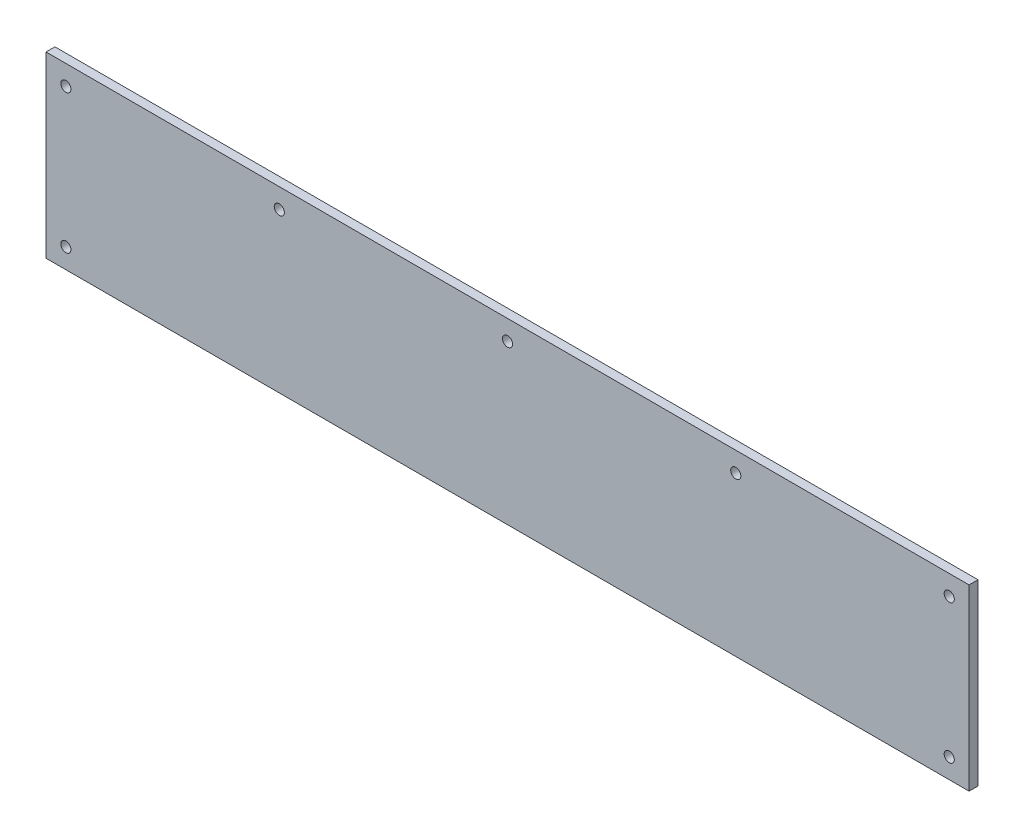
ISO-10303-21;
HEADER;
FILE_DESCRIPTION(('STEP AP214'),'2;1');
FILE_NAME('part.step','',(''),(''),'','','');
FILE_SCHEMA(('AUTOMOTIVE_DESIGN { 1 0 10303 214 1 1 1 1 }'));
ENDSEC;
DATA;
#1=APPLICATION_CONTEXT('core data for automotive mechanical design processes');
#2=APPLICATION_PROTOCOL_DEFINITION('international standard','automotive_design',2000,#1);
#3=PRODUCT_CONTEXT('',#1,'mechanical');
#4=PRODUCT('Part','Part','',(#3));
#5=PRODUCT_RELATED_PRODUCT_CATEGORY('part','',(#4));
#6=PRODUCT_DEFINITION_FORMATION('','',#4);
#7=PRODUCT_DEFINITION_CONTEXT('part definition',#1,'design');
#8=PRODUCT_DEFINITION('design','',#6,#7);
#9=PRODUCT_DEFINITION_SHAPE('','',#8);
#10=(LENGTH_UNIT() NAMED_UNIT(*) SI_UNIT(.MILLI.,.METRE.));
#11=(NAMED_UNIT(*) PLANE_ANGLE_UNIT() SI_UNIT($,.RADIAN.));
#12=(NAMED_UNIT(*) SI_UNIT($,.STERADIAN.) SOLID_ANGLE_UNIT());
#13=UNCERTAINTY_MEASURE_WITH_UNIT(LENGTH_MEASURE(1.E-05),#10,'distance_accuracy_value','');
#14=(GEOMETRIC_REPRESENTATION_CONTEXT(3) GLOBAL_UNCERTAINTY_ASSIGNED_CONTEXT((#13)) GLOBAL_UNIT_ASSIGNED_CONTEXT((#10,
#11,#12)) REPRESENTATION_CONTEXT('',''));
#15=CARTESIAN_POINT('',(0.,0.,0.));
#16=DIRECTION('',(0.,0.,1.));
#17=DIRECTION('',(1.,0.,0.));
#18=AXIS2_PLACEMENT_3D('',#15,#16,#17);
#19=CARTESIAN_POINT('',(0.,0.,2.2479));
#20=DIRECTION('',(0.,0.,-1.));
#21=DIRECTION('',(-1.,0.,0.));
#22=AXIS2_PLACEMENT_3D('',#19,#20,#21);
#23=PLANE('',#22);
#24=DIRECTION('',(0.,1.,0.));
#25=VECTOR('',#24,1.);
#26=CARTESIAN_POINT('',(232.5,-45.,2.2479));
#27=LINE('',#26,#25);
#28=CARTESIAN_POINT('',(232.5,-45.,2.2479));
#29=VERTEX_POINT('',#28);
#30=CARTESIAN_POINT('',(232.5,45.,2.2479));
#31=VERTEX_POINT('',#30);
#32=EDGE_CURVE('E82',#29,#31,#27,.T.);
#33=ORIENTED_EDGE('',*,*,#32,.T.);
#34=DIRECTION('',(-1.,0.,0.));
#35=VECTOR('',#34,1.);
#36=CARTESIAN_POINT('',(-232.5,45.,2.2479));
#37=LINE('',#36,#35);
#38=CARTESIAN_POINT('',(-232.5,45.,2.2479));
#39=VERTEX_POINT('',#38);
#40=EDGE_CURVE('E77',#31,#39,#37,.T.);
#41=ORIENTED_EDGE('',*,*,#40,.T.);
#42=DIRECTION('',(0.,-1.,0.));
#43=VECTOR('',#42,1.);
#44=CARTESIAN_POINT('',(-232.5,-44.9999999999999,2.2479));
#45=LINE('',#44,#43);
#46=CARTESIAN_POINT('',(-232.5,-44.9999999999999,2.2479));
#47=VERTEX_POINT('',#46);
#48=EDGE_CURVE('E80',#39,#47,#45,.T.);
#49=ORIENTED_EDGE('',*,*,#48,.T.);
#50=DIRECTION('',(1.,0.,0.));
#51=VECTOR('',#50,1.);
#52=CARTESIAN_POINT('',(-232.5,-44.9999999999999,2.2479));
#53=LINE('',#52,#51);
#54=EDGE_CURVE('E47',#47,#29,#53,.T.);
#55=ORIENTED_EDGE('',*,*,#54,.T.);
#56=EDGE_LOOP('',(#33,#41,#49,#55));
#57=FACE_BOUND('',#56,.T.);
#58=CARTESIAN_POINT('',(-222.5,35.,2.2479));
#59=DIRECTION('',(0.,0.,1.));
#60=DIRECTION('',(1.,0.,0.));
#61=AXIS2_PLACEMENT_3D('',#58,#59,#60);
#62=CIRCLE('',#61,2.54999999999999);
#63=CARTESIAN_POINT('',(-219.95,35.,2.2479));
#64=VERTEX_POINT('',#63);
#65=EDGE_CURVE('E97',#64,#64,#62,.T.);
#66=ORIENTED_EDGE('',*,*,#65,.F.);
#67=EDGE_LOOP('',(#66));
#68=FACE_BOUND('',#67,.T.);
#69=CARTESIAN_POINT('',(-222.5,-34.9999999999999,2.2479));
#70=DIRECTION('',(0.,0.,1.));
#71=DIRECTION('',(1.,0.,0.));
#72=AXIS2_PLACEMENT_3D('',#69,#70,#71);
#73=CIRCLE('',#72,2.54999999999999);
#74=CARTESIAN_POINT('',(-219.95,-34.9999999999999,2.2479));
#75=VERTEX_POINT('',#74);
#76=EDGE_CURVE('E112',#75,#75,#73,.T.);
#77=ORIENTED_EDGE('',*,*,#76,.F.);
#78=EDGE_LOOP('',(#77));
#79=FACE_BOUND('',#78,.T.);
#80=CARTESIAN_POINT('',(0.,35.,2.2479));
#81=DIRECTION('',(0.,0.,1.));
#82=DIRECTION('',(1.,0.,0.));
#83=AXIS2_PLACEMENT_3D('',#80,#81,#82);
#84=CIRCLE('',#83,2.55);
#85=CARTESIAN_POINT('',(2.55,35.,2.2479));
#86=VERTEX_POINT('',#85);
#87=EDGE_CURVE('E118',#86,#86,#84,.T.);
#88=ORIENTED_EDGE('',*,*,#87,.F.);
#89=EDGE_LOOP('',(#88));
#90=FACE_BOUND('',#89,.T.);
#91=CARTESIAN_POINT('',(-114.975,35.,2.2479));
#92=DIRECTION('',(0.,0.,1.));
#93=DIRECTION('',(1.,0.,0.));
#94=AXIS2_PLACEMENT_3D('',#91,#92,#93);
#95=CIRCLE('',#94,2.54999999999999);
#96=CARTESIAN_POINT('',(-112.425,35.,2.2479));
#97=VERTEX_POINT('',#96);
#98=EDGE_CURVE('E124',#97,#97,#95,.T.);
#99=ORIENTED_EDGE('',*,*,#98,.F.);
#100=EDGE_LOOP('',(#99));
#101=FACE_BOUND('',#100,.T.);
#102=CARTESIAN_POINT('',(222.5,-34.9999999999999,2.2479));
#103=DIRECTION('',(0.,0.,1.));
#104=DIRECTION('',(-1.,0.,0.));
#105=AXIS2_PLACEMENT_3D('',#102,#103,#104);
#106=CIRCLE('',#105,2.54999999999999);
#107=CARTESIAN_POINT('',(219.95,-34.9999999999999,2.2479));
#108=VERTEX_POINT('',#107);
#109=EDGE_CURVE('E130',#108,#108,#106,.T.);
#110=ORIENTED_EDGE('',*,*,#109,.F.);
#111=EDGE_LOOP('',(#110));
#112=FACE_BOUND('',#111,.T.);
#113=CARTESIAN_POINT('',(222.5,35.,2.2479));
#114=DIRECTION('',(0.,0.,1.));
#115=DIRECTION('',(-1.,0.,0.));
#116=AXIS2_PLACEMENT_3D('',#113,#114,#115);
#117=CIRCLE('',#116,2.54999999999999);
#118=CARTESIAN_POINT('',(219.95,35.,2.2479));
#119=VERTEX_POINT('',#118);
#120=EDGE_CURVE('E136',#119,#119,#117,.T.);
#121=ORIENTED_EDGE('',*,*,#120,.F.);
#122=EDGE_LOOP('',(#121));
#123=FACE_BOUND('',#122,.T.);
#124=CARTESIAN_POINT('',(114.975,35.,2.2479));
#125=DIRECTION('',(0.,0.,1.));
#126=DIRECTION('',(-1.,0.,0.));
#127=AXIS2_PLACEMENT_3D('',#124,#125,#126);
#128=CIRCLE('',#127,2.54999999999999);
#129=CARTESIAN_POINT('',(112.425,35.,2.2479));
#130=VERTEX_POINT('',#129);
#131=EDGE_CURVE('E142',#130,#130,#128,.T.);
#132=ORIENTED_EDGE('',*,*,#131,.F.);
#133=EDGE_LOOP('',(#132));
#134=FACE_BOUND('',#133,.T.);
#135=ADVANCED_FACE('F30',(#57,#68,#79,#90,#101,#112,#123,#134),#23,.F.);
#136=CARTESIAN_POINT('',(0.,0.,-2.2479));
#137=DIRECTION('',(0.,0.,-1.));
#138=DIRECTION('',(-1.,0.,0.));
#139=AXIS2_PLACEMENT_3D('',#136,#137,#138);
#140=PLANE('',#139);
#141=CARTESIAN_POINT('',(222.5,35.,-2.2479));
#142=DIRECTION('',(0.,0.,1.));
#143=DIRECTION('',(-1.,0.,0.));
#144=AXIS2_PLACEMENT_3D('',#141,#142,#143);
#145=CIRCLE('',#144,2.54999999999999);
#146=CARTESIAN_POINT('',(219.95,35.,-2.2479));
#147=VERTEX_POINT('',#146);
#148=EDGE_CURVE('E139',#147,#147,#145,.T.);
#149=ORIENTED_EDGE('',*,*,#148,.T.);
#150=EDGE_LOOP('',(#149));
#151=FACE_BOUND('',#150,.T.);
#152=CARTESIAN_POINT('',(-114.975,35.,-2.2479));
#153=DIRECTION('',(0.,0.,1.));
#154=DIRECTION('',(1.,0.,0.));
#155=AXIS2_PLACEMENT_3D('',#152,#153,#154);
#156=CIRCLE('',#155,2.54999999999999);
#157=CARTESIAN_POINT('',(-112.425,35.,-2.2479));
#158=VERTEX_POINT('',#157);
#159=EDGE_CURVE('E127',#158,#158,#156,.T.);
#160=ORIENTED_EDGE('',*,*,#159,.T.);
#161=EDGE_LOOP('',(#160));
#162=FACE_BOUND('',#161,.T.);
#163=CARTESIAN_POINT('',(-222.5,-34.9999999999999,-2.2479));
#164=DIRECTION('',(0.,0.,1.));
#165=DIRECTION('',(1.,0.,0.));
#166=AXIS2_PLACEMENT_3D('',#163,#164,#165);
#167=CIRCLE('',#166,2.54999999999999);
#168=CARTESIAN_POINT('',(-219.95,-34.9999999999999,-2.2479));
#169=VERTEX_POINT('',#168);
#170=EDGE_CURVE('E115',#169,#169,#167,.T.);
#171=ORIENTED_EDGE('',*,*,#170,.T.);
#172=EDGE_LOOP('',(#171));
#173=FACE_BOUND('',#172,.T.);
#174=DIRECTION('',(0.,1.,0.));
#175=VECTOR('',#174,1.);
#176=CARTESIAN_POINT('',(232.5,-45.,-2.2479));
#177=LINE('',#176,#175);
#178=CARTESIAN_POINT('',(232.5,-45.,-2.2479));
#179=VERTEX_POINT('',#178);
#180=CARTESIAN_POINT('',(232.5,45.,-2.2479));
#181=VERTEX_POINT('',#180);
#182=EDGE_CURVE('E94',#179,#181,#177,.T.);
#183=ORIENTED_EDGE('',*,*,#182,.F.);
#184=DIRECTION('',(1.,0.,0.));
#185=VECTOR('',#184,1.);
#186=CARTESIAN_POINT('',(-232.5,-44.9999999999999,-2.2479));
#187=LINE('',#186,#185);
#188=CARTESIAN_POINT('',(-232.5,-44.9999999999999,-2.2479));
#189=VERTEX_POINT('',#188);
#190=EDGE_CURVE('E70',#189,#179,#187,.T.);
#191=ORIENTED_EDGE('',*,*,#190,.F.);
#192=DIRECTION('',(0.,-1.,0.));
#193=VECTOR('',#192,1.);
#194=CARTESIAN_POINT('',(-232.5,-44.9999999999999,-2.2479));
#195=LINE('',#194,#193);
#196=CARTESIAN_POINT('',(-232.5,45.,-2.2479));
#197=VERTEX_POINT('',#196);
#198=EDGE_CURVE('E64',#197,#189,#195,.T.);
#199=ORIENTED_EDGE('',*,*,#198,.F.);
#200=DIRECTION('',(-1.,0.,0.));
#201=VECTOR('',#200,1.);
#202=CARTESIAN_POINT('',(-232.5,45.,-2.2479));
#203=LINE('',#202,#201);
#204=EDGE_CURVE('E86',#181,#197,#203,.T.);
#205=ORIENTED_EDGE('',*,*,#204,.F.);
#206=EDGE_LOOP('',(#183,#191,#199,#205));
#207=FACE_BOUND('',#206,.T.);
#208=CARTESIAN_POINT('',(-222.5,35.,-2.2479));
#209=DIRECTION('',(0.,0.,1.));
#210=DIRECTION('',(1.,0.,0.));
#211=AXIS2_PLACEMENT_3D('',#208,#209,#210);
#212=CIRCLE('',#211,2.54999999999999);
#213=CARTESIAN_POINT('',(-219.95,35.,-2.2479));
#214=VERTEX_POINT('',#213);
#215=EDGE_CURVE('E109',#214,#214,#212,.T.);
#216=ORIENTED_EDGE('',*,*,#215,.T.);
#217=EDGE_LOOP('',(#216));
#218=FACE_BOUND('',#217,.T.);
#219=CARTESIAN_POINT('',(0.,35.,-2.2479));
#220=DIRECTION('',(0.,0.,1.));
#221=DIRECTION('',(1.,0.,0.));
#222=AXIS2_PLACEMENT_3D('',#219,#220,#221);
#223=CIRCLE('',#222,2.55);
#224=CARTESIAN_POINT('',(2.55,35.,-2.2479));
#225=VERTEX_POINT('',#224);
#226=EDGE_CURVE('E121',#225,#225,#223,.T.);
#227=ORIENTED_EDGE('',*,*,#226,.T.);
#228=EDGE_LOOP('',(#227));
#229=FACE_BOUND('',#228,.T.);
#230=CARTESIAN_POINT('',(222.5,-34.9999999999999,-2.2479));
#231=DIRECTION('',(0.,0.,1.));
#232=DIRECTION('',(-1.,0.,0.));
#233=AXIS2_PLACEMENT_3D('',#230,#231,#232);
#234=CIRCLE('',#233,2.54999999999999);
#235=CARTESIAN_POINT('',(219.95,-34.9999999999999,-2.2479));
#236=VERTEX_POINT('',#235);
#237=EDGE_CURVE('E133',#236,#236,#234,.T.);
#238=ORIENTED_EDGE('',*,*,#237,.T.);
#239=EDGE_LOOP('',(#238));
#240=FACE_BOUND('',#239,.T.);
#241=CARTESIAN_POINT('',(114.975,35.,-2.2479));
#242=DIRECTION('',(0.,0.,1.));
#243=DIRECTION('',(-1.,0.,0.));
#244=AXIS2_PLACEMENT_3D('',#241,#242,#243);
#245=CIRCLE('',#244,2.54999999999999);
#246=CARTESIAN_POINT('',(112.425,35.,-2.2479));
#247=VERTEX_POINT('',#246);
#248=EDGE_CURVE('E145',#247,#247,#245,.T.);
#249=ORIENTED_EDGE('',*,*,#248,.T.);
#250=EDGE_LOOP('',(#249));
#251=FACE_BOUND('',#250,.T.);
#252=ADVANCED_FACE('F105',(#151,#162,#173,#207,#218,#229,#240,#251),#140,.T.);
#253=CARTESIAN_POINT('',(232.5,-45.,2.2479));
#254=DIRECTION('',(-1.,0.,0.));
#255=DIRECTION('',(0.,0.,1.));
#256=AXIS2_PLACEMENT_3D('',#253,#254,#255);
#257=PLANE('',#256);
#258=ORIENTED_EDGE('',*,*,#182,.T.);
#259=DIRECTION('',(0.,0.,-1.));
#260=VECTOR('',#259,1.);
#261=CARTESIAN_POINT('',(232.5,45.,2.2479));
#262=LINE('',#261,#260);
#263=EDGE_CURVE('E11',#31,#181,#262,.T.);
#264=ORIENTED_EDGE('',*,*,#263,.F.);
#265=ORIENTED_EDGE('',*,*,#32,.F.);
#266=DIRECTION('',(0.,0.,-1.));
#267=VECTOR('',#266,1.);
#268=CARTESIAN_POINT('',(232.5,-45.,2.2479));
#269=LINE('',#268,#267);
#270=EDGE_CURVE('E90',#29,#179,#269,.T.);
#271=ORIENTED_EDGE('',*,*,#270,.T.);
#272=EDGE_LOOP('',(#258,#264,#265,#271));
#273=FACE_BOUND('',#272,.T.);
#274=ADVANCED_FACE('F32',(#273),#257,.F.);
#275=CARTESIAN_POINT('',(-232.5,45.,2.2479));
#276=DIRECTION('',(0.,-1.,0.));
#277=DIRECTION('',(0.,0.,-1.));
#278=AXIS2_PLACEMENT_3D('',#275,#276,#277);
#279=PLANE('',#278);
#280=ORIENTED_EDGE('',*,*,#204,.T.);
#281=DIRECTION('',(0.,0.,-1.));
#282=VECTOR('',#281,1.);
#283=CARTESIAN_POINT('',(-232.5,45.,2.2479));
#284=LINE('',#283,#282);
#285=EDGE_CURVE('E39',#39,#197,#284,.T.);
#286=ORIENTED_EDGE('',*,*,#285,.F.);
#287=ORIENTED_EDGE('',*,*,#40,.F.);
#288=ORIENTED_EDGE('',*,*,#263,.T.);
#289=EDGE_LOOP('',(#280,#286,#287,#288));
#290=FACE_BOUND('',#289,.T.);
#291=ADVANCED_FACE('F85',(#290),#279,.F.);
#292=CARTESIAN_POINT('',(-232.5,-44.9999999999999,2.2479));
#293=DIRECTION('',(1.,0.,0.));
#294=DIRECTION('',(0.,0.,-1.));
#295=AXIS2_PLACEMENT_3D('',#292,#293,#294);
#296=PLANE('',#295);
#297=ORIENTED_EDGE('',*,*,#198,.T.);
#298=DIRECTION('',(0.,0.,-1.));
#299=VECTOR('',#298,1.);
#300=CARTESIAN_POINT('',(-232.5,-44.9999999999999,2.2479));
#301=LINE('',#300,#299);
#302=EDGE_CURVE('E87',#47,#189,#301,.T.);
#303=ORIENTED_EDGE('',*,*,#302,.F.);
#304=ORIENTED_EDGE('',*,*,#48,.F.);
#305=ORIENTED_EDGE('',*,*,#285,.T.);
#306=EDGE_LOOP('',(#297,#303,#304,#305));
#307=FACE_BOUND('',#306,.T.);
#308=ADVANCED_FACE('F88',(#307),#296,.F.);
#309=CARTESIAN_POINT('',(-232.5,-44.9999999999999,2.2479));
#310=DIRECTION('',(0.,1.,0.));
#311=DIRECTION('',(0.,0.,1.));
#312=AXIS2_PLACEMENT_3D('',#309,#310,#311);
#313=PLANE('',#312);
#314=ORIENTED_EDGE('',*,*,#190,.T.);
#315=ORIENTED_EDGE('',*,*,#270,.F.);
#316=ORIENTED_EDGE('',*,*,#54,.F.);
#317=ORIENTED_EDGE('',*,*,#302,.T.);
#318=EDGE_LOOP('',(#314,#315,#316,#317));
#319=FACE_BOUND('',#318,.T.);
#320=ADVANCED_FACE('F102',(#319),#313,.F.);
#321=CARTESIAN_POINT('',(-222.5,35.,2.2479));
#322=DIRECTION('',(0.,0.,-1.));
#323=DIRECTION('',(-1.,0.,0.));
#324=AXIS2_PLACEMENT_3D('',#321,#322,#323);
#325=CYLINDRICAL_SURFACE('',#324,2.54999999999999);
#326=ORIENTED_EDGE('',*,*,#65,.T.);
#327=EDGE_LOOP('',(#326));
#328=FACE_BOUND('',#327,.T.);
#329=ORIENTED_EDGE('',*,*,#215,.F.);
#330=EDGE_LOOP('',(#329));
#331=FACE_BOUND('',#330,.T.);
#332=ADVANCED_FACE('F162',(#328,#331),#325,.F.);
#333=CARTESIAN_POINT('',(-222.5,-34.9999999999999,2.2479));
#334=DIRECTION('',(0.,0.,-1.));
#335=DIRECTION('',(-1.,0.,0.));
#336=AXIS2_PLACEMENT_3D('',#333,#334,#335);
#337=CYLINDRICAL_SURFACE('',#336,2.54999999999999);
#338=ORIENTED_EDGE('',*,*,#76,.T.);
#339=EDGE_LOOP('',(#338));
#340=FACE_BOUND('',#339,.T.);
#341=ORIENTED_EDGE('',*,*,#170,.F.);
#342=EDGE_LOOP('',(#341));
#343=FACE_BOUND('',#342,.T.);
#344=ADVANCED_FACE('F197',(#340,#343),#337,.F.);
#345=CARTESIAN_POINT('',(0.,35.,2.2479));
#346=DIRECTION('',(0.,0.,-1.));
#347=DIRECTION('',(-1.,0.,0.));
#348=AXIS2_PLACEMENT_3D('',#345,#346,#347);
#349=CYLINDRICAL_SURFACE('',#348,2.55);
#350=ORIENTED_EDGE('',*,*,#87,.T.);
#351=EDGE_LOOP('',(#350));
#352=FACE_BOUND('',#351,.T.);
#353=ORIENTED_EDGE('',*,*,#226,.F.);
#354=EDGE_LOOP('',(#353));
#355=FACE_BOUND('',#354,.T.);
#356=ADVANCED_FACE('F204',(#352,#355),#349,.F.);
#357=CARTESIAN_POINT('',(-114.975,35.,2.2479));
#358=DIRECTION('',(0.,0.,-1.));
#359=DIRECTION('',(-1.,0.,0.));
#360=AXIS2_PLACEMENT_3D('',#357,#358,#359);
#361=CYLINDRICAL_SURFACE('',#360,2.54999999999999);
#362=ORIENTED_EDGE('',*,*,#98,.T.);
#363=EDGE_LOOP('',(#362));
#364=FACE_BOUND('',#363,.T.);
#365=ORIENTED_EDGE('',*,*,#159,.F.);
#366=EDGE_LOOP('',(#365));
#367=FACE_BOUND('',#366,.T.);
#368=ADVANCED_FACE('F211',(#364,#367),#361,.F.);
#369=CARTESIAN_POINT('',(222.5,-34.9999999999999,2.2479));
#370=DIRECTION('',(0.,0.,-1.));
#371=DIRECTION('',(-1.,0.,0.));
#372=AXIS2_PLACEMENT_3D('',#369,#370,#371);
#373=CYLINDRICAL_SURFACE('',#372,2.54999999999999);
#374=ORIENTED_EDGE('',*,*,#109,.T.);
#375=EDGE_LOOP('',(#374));
#376=FACE_BOUND('',#375,.T.);
#377=ORIENTED_EDGE('',*,*,#237,.F.);
#378=EDGE_LOOP('',(#377));
#379=FACE_BOUND('',#378,.T.);
#380=ADVANCED_FACE('F219',(#376,#379),#373,.F.);
#381=CARTESIAN_POINT('',(222.5,35.,2.2479));
#382=DIRECTION('',(0.,0.,-1.));
#383=DIRECTION('',(-1.,0.,0.));
#384=AXIS2_PLACEMENT_3D('',#381,#382,#383);
#385=CYLINDRICAL_SURFACE('',#384,2.54999999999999);
#386=ORIENTED_EDGE('',*,*,#120,.T.);
#387=EDGE_LOOP('',(#386));
#388=FACE_BOUND('',#387,.T.);
#389=ORIENTED_EDGE('',*,*,#148,.F.);
#390=EDGE_LOOP('',(#389));
#391=FACE_BOUND('',#390,.T.);
#392=ADVANCED_FACE('F227',(#388,#391),#385,.F.);
#393=CARTESIAN_POINT('',(114.975,35.,2.2479));
#394=DIRECTION('',(0.,0.,-1.));
#395=DIRECTION('',(-1.,0.,0.));
#396=AXIS2_PLACEMENT_3D('',#393,#394,#395);
#397=CYLINDRICAL_SURFACE('',#396,2.54999999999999);
#398=ORIENTED_EDGE('',*,*,#131,.T.);
#399=EDGE_LOOP('',(#398));
#400=FACE_BOUND('',#399,.T.);
#401=ORIENTED_EDGE('',*,*,#248,.F.);
#402=EDGE_LOOP('',(#401));
#403=FACE_BOUND('',#402,.T.);
#404=ADVANCED_FACE('F151',(#400,#403),#397,.F.);
#405=CLOSED_SHELL('',(#135,#252,#274,#291,#308,#320,#332,#344,#356,#368,#380,#392,#404));
#406=MANIFOLD_SOLID_BREP('B2',#405);
#407=ADVANCED_BREP_SHAPE_REPRESENTATION('',(#18,#406),#14);
#408=SHAPE_DEFINITION_REPRESENTATION(#9,#407);
ENDSEC;
END-ISO-10303-21;
